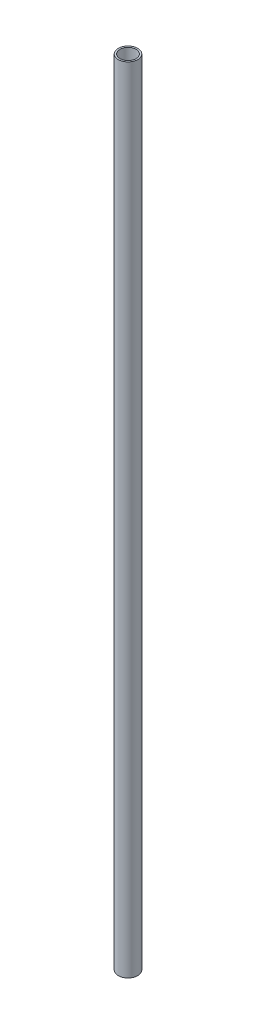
ISO-10303-21;
HEADER;
FILE_DESCRIPTION(('STEP AP214'),'2;1');
FILE_NAME('part.step','',(''),(''),'','','');
FILE_SCHEMA(('AUTOMOTIVE_DESIGN { 1 0 10303 214 1 1 1 1 }'));
ENDSEC;
DATA;
#1=APPLICATION_CONTEXT('core data for automotive mechanical design processes');
#2=APPLICATION_PROTOCOL_DEFINITION('international standard','automotive_design',2000,#1);
#3=PRODUCT_CONTEXT('',#1,'mechanical');
#4=PRODUCT('Part','Part','',(#3));
#5=PRODUCT_RELATED_PRODUCT_CATEGORY('part','',(#4));
#6=PRODUCT_DEFINITION_FORMATION('','',#4);
#7=PRODUCT_DEFINITION_CONTEXT('part definition',#1,'design');
#8=PRODUCT_DEFINITION('design','',#6,#7);
#9=PRODUCT_DEFINITION_SHAPE('','',#8);
#10=(LENGTH_UNIT() NAMED_UNIT(*) SI_UNIT(.MILLI.,.METRE.));
#11=(NAMED_UNIT(*) PLANE_ANGLE_UNIT() SI_UNIT($,.RADIAN.));
#12=(NAMED_UNIT(*) SI_UNIT($,.STERADIAN.) SOLID_ANGLE_UNIT());
#13=UNCERTAINTY_MEASURE_WITH_UNIT(LENGTH_MEASURE(1.E-05),#10,'distance_accuracy_value','');
#14=(GEOMETRIC_REPRESENTATION_CONTEXT(3) GLOBAL_UNCERTAINTY_ASSIGNED_CONTEXT((#13)) GLOBAL_UNIT_ASSIGNED_CONTEXT((#10,
#11,#12)) REPRESENTATION_CONTEXT('',''));
#15=CARTESIAN_POINT('',(0.,0.,0.));
#16=DIRECTION('',(0.,0.,1.));
#17=DIRECTION('',(1.,0.,0.));
#18=AXIS2_PLACEMENT_3D('',#15,#16,#17);
#19=CARTESIAN_POINT('',(0.,774.699999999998,-1.11022302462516E-13));
#20=DIRECTION('',(0.,0.999999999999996,0.));
#21=DIRECTION('',(0.,0.,0.999999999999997));
#22=AXIS2_PLACEMENT_3D('',#19,#20,#21);
#23=PLANE('',#22);
#24=CARTESIAN_POINT('',(0.,774.699999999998,-1.11022302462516E-13));
#25=DIRECTION('',(0.,0.999999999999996,0.));
#26=DIRECTION('',(0.,0.,0.999999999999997));
#27=AXIS2_PLACEMENT_3D('',#24,#25,#26);
#28=CIRCLE('',#27,9.525);
#29=CARTESIAN_POINT('',(0.,774.699999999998,-9.52500000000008));
#30=VERTEX_POINT('',#29);
#31=EDGE_CURVE('E13',#30,#30,#28,.T.);
#32=ORIENTED_EDGE('',*,*,#31,.T.);
#33=EDGE_LOOP('',(#32));
#34=FACE_BOUND('',#33,.T.);
#35=CARTESIAN_POINT('',(0.,774.699999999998,-1.11022302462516E-13));
#36=DIRECTION('',(0.,0.999999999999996,0.));
#37=DIRECTION('',(1.,0.,0.));
#38=AXIS2_PLACEMENT_3D('',#35,#36,#37);
#39=CIRCLE('',#38,7.874);
#40=CARTESIAN_POINT('',(0.,774.699999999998,-7.87400000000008));
#41=VERTEX_POINT('',#40);
#42=EDGE_CURVE('E57',#41,#41,#39,.T.);
#43=ORIENTED_EDGE('',*,*,#42,.F.);
#44=EDGE_LOOP('',(#43));
#45=FACE_BOUND('',#44,.T.);
#46=ADVANCED_FACE('F46',(#34,#45),#23,.T.);
#47=CARTESIAN_POINT('',(0.,0.,0.));
#48=DIRECTION('',(0.,0.999999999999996,0.));
#49=DIRECTION('',(0.,0.,0.999999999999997));
#50=AXIS2_PLACEMENT_3D('',#47,#48,#49);
#51=PLANE('',#50);
#52=CARTESIAN_POINT('',(0.,0.,0.));
#53=DIRECTION('',(0.,0.999999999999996,0.));
#54=DIRECTION('',(0.,0.,0.999999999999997));
#55=AXIS2_PLACEMENT_3D('',#52,#53,#54);
#56=CIRCLE('',#55,9.525);
#57=CARTESIAN_POINT('',(0.,-1.11022302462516E-13,-9.52500000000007));
#58=VERTEX_POINT('',#57);
#59=EDGE_CURVE('E50',#58,#58,#56,.T.);
#60=ORIENTED_EDGE('',*,*,#59,.F.);
#61=EDGE_LOOP('',(#60));
#62=FACE_BOUND('',#61,.T.);
#63=CARTESIAN_POINT('',(0.,0.,0.));
#64=DIRECTION('',(0.,0.999999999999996,0.));
#65=DIRECTION('',(1.,0.,0.));
#66=AXIS2_PLACEMENT_3D('',#63,#64,#65);
#67=CIRCLE('',#66,7.874);
#68=CARTESIAN_POINT('',(0.,-1.11022302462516E-13,-7.87400000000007));
#69=VERTEX_POINT('',#68);
#70=EDGE_CURVE('E59',#69,#69,#67,.T.);
#71=ORIENTED_EDGE('',*,*,#70,.T.);
#72=EDGE_LOOP('',(#71));
#73=FACE_BOUND('',#72,.T.);
#74=ADVANCED_FACE('F69',(#62,#73),#51,.F.);
#75=CARTESIAN_POINT('',(0.,774.699999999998,-1.11022302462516E-13));
#76=DIRECTION('',(0.,-0.999999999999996,0.));
#77=DIRECTION('',(0.,0.,-0.999999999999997));
#78=AXIS2_PLACEMENT_3D('',#75,#76,#77);
#79=CYLINDRICAL_SURFACE('',#78,9.525);
#80=CARTESIAN_POINT('',(0.,774.699999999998,-9.52500000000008));
#81=CARTESIAN_POINT('',(0.,766.630208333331,-9.52500000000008));
#82=CARTESIAN_POINT('',(0.,758.560416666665,-9.52500000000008));
#83=CARTESIAN_POINT('',(0.,742.420833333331,-9.52500000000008));
#84=CARTESIAN_POINT('',(0.,734.351041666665,-9.52500000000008));
#85=CARTESIAN_POINT('',(0.,718.211458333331,-9.52500000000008));
#86=CARTESIAN_POINT('',(0.,710.141666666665,-9.52500000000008));
#87=CARTESIAN_POINT('',(0.,694.002083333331,-9.52500000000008));
#88=CARTESIAN_POINT('',(0.,685.932291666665,-9.52500000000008));
#89=CARTESIAN_POINT('',(0.,669.792708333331,-9.52500000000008));
#90=CARTESIAN_POINT('',(0.,661.722916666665,-9.52500000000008));
#91=CARTESIAN_POINT('',(0.,645.583333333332,-9.52500000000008));
#92=CARTESIAN_POINT('',(0.,637.513541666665,-9.52500000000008));
#93=CARTESIAN_POINT('',(0.,621.373958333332,-9.52500000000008));
#94=CARTESIAN_POINT('',(0.,613.304166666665,-9.52500000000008));
#95=CARTESIAN_POINT('',(0.,597.164583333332,-9.52500000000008));
#96=CARTESIAN_POINT('',(0.,589.094791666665,-9.52500000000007));
#97=CARTESIAN_POINT('',(0.,572.955208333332,-9.52500000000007));
#98=CARTESIAN_POINT('',(0.,564.885416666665,-9.52500000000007));
#99=CARTESIAN_POINT('',(0.,548.745833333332,-9.52500000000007));
#100=CARTESIAN_POINT('',(0.,540.676041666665,-9.52500000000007));
#101=CARTESIAN_POINT('',(0.,524.536458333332,-9.52500000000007));
#102=CARTESIAN_POINT('',(0.,516.466666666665,-9.52500000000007));
#103=CARTESIAN_POINT('',(0.,500.327083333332,-9.52500000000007));
#104=CARTESIAN_POINT('',(0.,492.257291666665,-9.52500000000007));
#105=CARTESIAN_POINT('',(0.,476.117708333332,-9.52500000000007));
#106=CARTESIAN_POINT('',(0.,468.047916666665,-9.52500000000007));
#107=CARTESIAN_POINT('',(0.,451.908333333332,-9.52500000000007));
#108=CARTESIAN_POINT('',(0.,443.838541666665,-9.52500000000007));
#109=CARTESIAN_POINT('',(0.,427.698958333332,-9.52500000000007));
#110=CARTESIAN_POINT('',(0.,419.629166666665,-9.52500000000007));
#111=CARTESIAN_POINT('',(0.,403.489583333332,-9.52500000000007));
#112=CARTESIAN_POINT('',(0.,395.419791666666,-9.52500000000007));
#113=CARTESIAN_POINT('',(0.,379.280208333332,-9.52500000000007));
#114=CARTESIAN_POINT('',(0.,371.210416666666,-9.52500000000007));
#115=CARTESIAN_POINT('',(0.,355.070833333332,-9.52500000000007));
#116=CARTESIAN_POINT('',(0.,347.001041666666,-9.52500000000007));
#117=CARTESIAN_POINT('',(0.,330.861458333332,-9.52500000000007));
#118=CARTESIAN_POINT('',(0.,322.791666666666,-9.52500000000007));
#119=CARTESIAN_POINT('',(0.,306.652083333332,-9.52500000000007));
#120=CARTESIAN_POINT('',(0.,298.582291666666,-9.52500000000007));
#121=CARTESIAN_POINT('',(0.,282.442708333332,-9.52500000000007));
#122=CARTESIAN_POINT('',(0.,274.372916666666,-9.52500000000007));
#123=CARTESIAN_POINT('',(0.,258.233333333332,-9.52500000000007));
#124=CARTESIAN_POINT('',(0.,250.163541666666,-9.52500000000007));
#125=CARTESIAN_POINT('',(0.,234.023958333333,-9.52500000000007));
#126=CARTESIAN_POINT('',(0.,225.954166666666,-9.52500000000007));
#127=CARTESIAN_POINT('',(0.,209.814583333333,-9.52500000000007));
#128=CARTESIAN_POINT('',(0.,201.744791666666,-9.52500000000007));
#129=CARTESIAN_POINT('',(0.,185.605208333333,-9.52500000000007));
#130=CARTESIAN_POINT('',(0.,177.535416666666,-9.52500000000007));
#131=CARTESIAN_POINT('',(0.,161.395833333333,-9.52500000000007));
#132=CARTESIAN_POINT('',(0.,153.326041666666,-9.52500000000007));
#133=CARTESIAN_POINT('',(0.,137.186458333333,-9.52500000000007));
#134=CARTESIAN_POINT('',(0.,129.116666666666,-9.52500000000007));
#135=CARTESIAN_POINT('',(0.,112.977083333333,-9.52500000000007));
#136=CARTESIAN_POINT('',(0.,104.907291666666,-9.52500000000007));
#137=CARTESIAN_POINT('',(0.,88.7677083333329,-9.52500000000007));
#138=CARTESIAN_POINT('',(0.,80.6979166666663,-9.52500000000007));
#139=CARTESIAN_POINT('',(0.,64.558333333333,-9.52500000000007));
#140=CARTESIAN_POINT('',(0.,56.4885416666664,-9.52500000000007));
#141=CARTESIAN_POINT('',(0.,40.3489583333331,-9.52500000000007));
#142=CARTESIAN_POINT('',(0.,32.2791666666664,-9.52500000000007));
#143=CARTESIAN_POINT('',(0.,16.1395833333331,-9.52500000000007));
#144=CARTESIAN_POINT('',(0.,8.06979166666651,-9.52500000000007));
#145=CARTESIAN_POINT('',(0.,-1.11022302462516E-13,-9.52500000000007));
#146=B_SPLINE_CURVE_WITH_KNOTS('',3,(#80,#81,#82,#83,#84,#85,#86,#87,#88,#89,#90,#91,#92,#93,
#94,#95,#96,#97,#98,#99,#100,#101,#102,#103,#104,#105,#106,#107,#108,#109,#110,#111,#112,#113,
#114,#115,#116,#117,#118,#119,#120,#121,#122,#123,#124,#125,#126,#127,#128,#129,#130,#131,#132,
#133,#134,#135,#136,#137,#138,#139,#140,#141,#142,#143,#144,#145),.UNSPECIFIED.,.F.,.F.,(4,2,2,
2,2,2,2,2,2,2,2,2,2,2,2,2,2,2,2,2,2,2,2,2,2,2,2,2,2,2,2,2,4),(0.,24.2093749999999,
48.4187499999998,72.6281249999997,96.8374999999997,121.046875,145.25625,169.465625,
193.674999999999,217.884374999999,242.093749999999,266.303124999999,290.512499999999,
314.721874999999,338.931249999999,363.140624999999,387.349999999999,411.559374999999,
435.768749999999,459.978124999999,484.187499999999,508.396874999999,532.606249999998,
556.815624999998,581.024999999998,605.234374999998,629.443749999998,653.653124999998,
677.862499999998,702.071874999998,726.281249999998,750.490624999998,774.699999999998),.UNSPECIFIED.);
#147=EDGE_CURVE('BSEAM48',#30,#58,#146,.T.);
#148=ORIENTED_EDGE('',*,*,#31,.F.);
#149=ORIENTED_EDGE('',*,*,#59,.T.);
#150=ORIENTED_EDGE('',*,*,#147,.T.);
#151=ORIENTED_EDGE('',*,*,#147,.F.);
#152=EDGE_LOOP('',(#148,#150,#149,#151));
#153=FACE_BOUND('',#152,.T.);
#154=ADVANCED_FACE('F48',(#153),#79,.T.);
#155=CARTESIAN_POINT('',(0.,774.699999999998,-1.11022302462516E-13));
#156=DIRECTION('',(0.,-0.999999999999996,0.));
#157=DIRECTION('',(0.,0.,-0.999999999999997));
#158=AXIS2_PLACEMENT_3D('',#155,#156,#157);
#159=CYLINDRICAL_SURFACE('',#158,7.874);
#160=CARTESIAN_POINT('',(0.,774.699999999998,-7.87400000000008));
#161=CARTESIAN_POINT('',(0.,766.630208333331,-7.87400000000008));
#162=CARTESIAN_POINT('',(0.,758.560416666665,-7.87400000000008));
#163=CARTESIAN_POINT('',(0.,742.420833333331,-7.87400000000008));
#164=CARTESIAN_POINT('',(0.,734.351041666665,-7.87400000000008));
#165=CARTESIAN_POINT('',(0.,718.211458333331,-7.87400000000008));
#166=CARTESIAN_POINT('',(0.,710.141666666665,-7.87400000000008));
#167=CARTESIAN_POINT('',(0.,694.002083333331,-7.87400000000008));
#168=CARTESIAN_POINT('',(0.,685.932291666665,-7.87400000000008));
#169=CARTESIAN_POINT('',(0.,669.792708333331,-7.87400000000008));
#170=CARTESIAN_POINT('',(0.,661.722916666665,-7.87400000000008));
#171=CARTESIAN_POINT('',(0.,645.583333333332,-7.87400000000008));
#172=CARTESIAN_POINT('',(0.,637.513541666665,-7.87400000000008));
#173=CARTESIAN_POINT('',(0.,621.373958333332,-7.87400000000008));
#174=CARTESIAN_POINT('',(0.,613.304166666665,-7.87400000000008));
#175=CARTESIAN_POINT('',(0.,597.164583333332,-7.87400000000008));
#176=CARTESIAN_POINT('',(0.,589.094791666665,-7.87400000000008));
#177=CARTESIAN_POINT('',(0.,572.955208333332,-7.87400000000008));
#178=CARTESIAN_POINT('',(0.,564.885416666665,-7.87400000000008));
#179=CARTESIAN_POINT('',(0.,548.745833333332,-7.87400000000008));
#180=CARTESIAN_POINT('',(0.,540.676041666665,-7.87400000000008));
#181=CARTESIAN_POINT('',(0.,524.536458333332,-7.87400000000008));
#182=CARTESIAN_POINT('',(0.,516.466666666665,-7.87400000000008));
#183=CARTESIAN_POINT('',(0.,500.327083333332,-7.87400000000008));
#184=CARTESIAN_POINT('',(0.,492.257291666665,-7.87400000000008));
#185=CARTESIAN_POINT('',(0.,476.117708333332,-7.87400000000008));
#186=CARTESIAN_POINT('',(0.,468.047916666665,-7.87400000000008));
#187=CARTESIAN_POINT('',(0.,451.908333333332,-7.87400000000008));
#188=CARTESIAN_POINT('',(0.,443.838541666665,-7.87400000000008));
#189=CARTESIAN_POINT('',(0.,427.698958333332,-7.87400000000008));
#190=CARTESIAN_POINT('',(0.,419.629166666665,-7.87400000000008));
#191=CARTESIAN_POINT('',(0.,403.489583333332,-7.87400000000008));
#192=CARTESIAN_POINT('',(0.,395.419791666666,-7.87400000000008));
#193=CARTESIAN_POINT('',(0.,379.280208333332,-7.87400000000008));
#194=CARTESIAN_POINT('',(0.,371.210416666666,-7.87400000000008));
#195=CARTESIAN_POINT('',(0.,355.070833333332,-7.87400000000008));
#196=CARTESIAN_POINT('',(0.,347.001041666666,-7.87400000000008));
#197=CARTESIAN_POINT('',(0.,330.861458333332,-7.87400000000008));
#198=CARTESIAN_POINT('',(0.,322.791666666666,-7.87400000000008));
#199=CARTESIAN_POINT('',(0.,306.652083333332,-7.87400000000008));
#200=CARTESIAN_POINT('',(0.,298.582291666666,-7.87400000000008));
#201=CARTESIAN_POINT('',(0.,282.442708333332,-7.87400000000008));
#202=CARTESIAN_POINT('',(0.,274.372916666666,-7.87400000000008));
#203=CARTESIAN_POINT('',(0.,258.233333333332,-7.87400000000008));
#204=CARTESIAN_POINT('',(0.,250.163541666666,-7.87400000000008));
#205=CARTESIAN_POINT('',(0.,234.023958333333,-7.87400000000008));
#206=CARTESIAN_POINT('',(0.,225.954166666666,-7.87400000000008));
#207=CARTESIAN_POINT('',(0.,209.814583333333,-7.87400000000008));
#208=CARTESIAN_POINT('',(0.,201.744791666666,-7.87400000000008));
#209=CARTESIAN_POINT('',(0.,185.605208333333,-7.87400000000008));
#210=CARTESIAN_POINT('',(0.,177.535416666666,-7.87400000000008));
#211=CARTESIAN_POINT('',(0.,161.395833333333,-7.87400000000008));
#212=CARTESIAN_POINT('',(0.,153.326041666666,-7.87400000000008));
#213=CARTESIAN_POINT('',(0.,137.186458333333,-7.87400000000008));
#214=CARTESIAN_POINT('',(0.,129.116666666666,-7.87400000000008));
#215=CARTESIAN_POINT('',(0.,112.977083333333,-7.87400000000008));
#216=CARTESIAN_POINT('',(0.,104.907291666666,-7.87400000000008));
#217=CARTESIAN_POINT('',(0.,88.7677083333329,-7.87400000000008));
#218=CARTESIAN_POINT('',(0.,80.6979166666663,-7.87400000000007));
#219=CARTESIAN_POINT('',(0.,64.558333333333,-7.87400000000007));
#220=CARTESIAN_POINT('',(0.,56.4885416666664,-7.87400000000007));
#221=CARTESIAN_POINT('',(0.,40.3489583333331,-7.87400000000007));
#222=CARTESIAN_POINT('',(0.,32.2791666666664,-7.87400000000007));
#223=CARTESIAN_POINT('',(0.,16.1395833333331,-7.87400000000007));
#224=CARTESIAN_POINT('',(0.,8.06979166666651,-7.87400000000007));
#225=CARTESIAN_POINT('',(0.,-1.11022302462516E-13,-7.87400000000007));
#226=B_SPLINE_CURVE_WITH_KNOTS('',3,(#160,#161,#162,#163,#164,#165,#166,#167,#168,#169,#170,
#171,#172,#173,#174,#175,#176,#177,#178,#179,#180,#181,#182,#183,#184,#185,#186,#187,#188,#189,
#190,#191,#192,#193,#194,#195,#196,#197,#198,#199,#200,#201,#202,#203,#204,#205,#206,#207,#208,
#209,#210,#211,#212,#213,#214,#215,#216,#217,#218,#219,#220,#221,#222,#223,#224,#225),
.UNSPECIFIED.,.F.,.F.,(4,2,2,2,2,2,2,2,2,2,2,2,2,2,2,2,2,2,2,2,2,2,2,2,2,2,2,2,2,2,2,2,4),(0.,
24.2093749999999,48.4187499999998,72.6281249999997,96.8374999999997,121.046875,145.25625,
169.465625,193.674999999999,217.884374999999,242.093749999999,266.303124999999,290.512499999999,
314.721874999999,338.931249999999,363.140624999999,387.349999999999,411.559374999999,
435.768749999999,459.978124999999,484.187499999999,508.396874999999,532.606249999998,
556.815624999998,581.024999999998,605.234374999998,629.443749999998,653.653124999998,
677.862499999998,702.071874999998,726.281249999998,750.490624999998,774.699999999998),.UNSPECIFIED.);
#227=EDGE_CURVE('BSEAM65',#41,#69,#226,.T.);
#228=ORIENTED_EDGE('',*,*,#42,.T.);
#229=ORIENTED_EDGE('',*,*,#70,.F.);
#230=ORIENTED_EDGE('',*,*,#227,.T.);
#231=ORIENTED_EDGE('',*,*,#227,.F.);
#232=EDGE_LOOP('',(#228,#230,#229,#231));
#233=FACE_BOUND('',#232,.T.);
#234=ADVANCED_FACE('F65',(#233),#159,.F.);
#235=CLOSED_SHELL('',(#46,#74,#154,#234));
#236=MANIFOLD_SOLID_BREP('B2',#235);
#237=ADVANCED_BREP_SHAPE_REPRESENTATION('',(#18,#236),#14);
#238=SHAPE_DEFINITION_REPRESENTATION(#9,#237);
ENDSEC;
END-ISO-10303-21;
